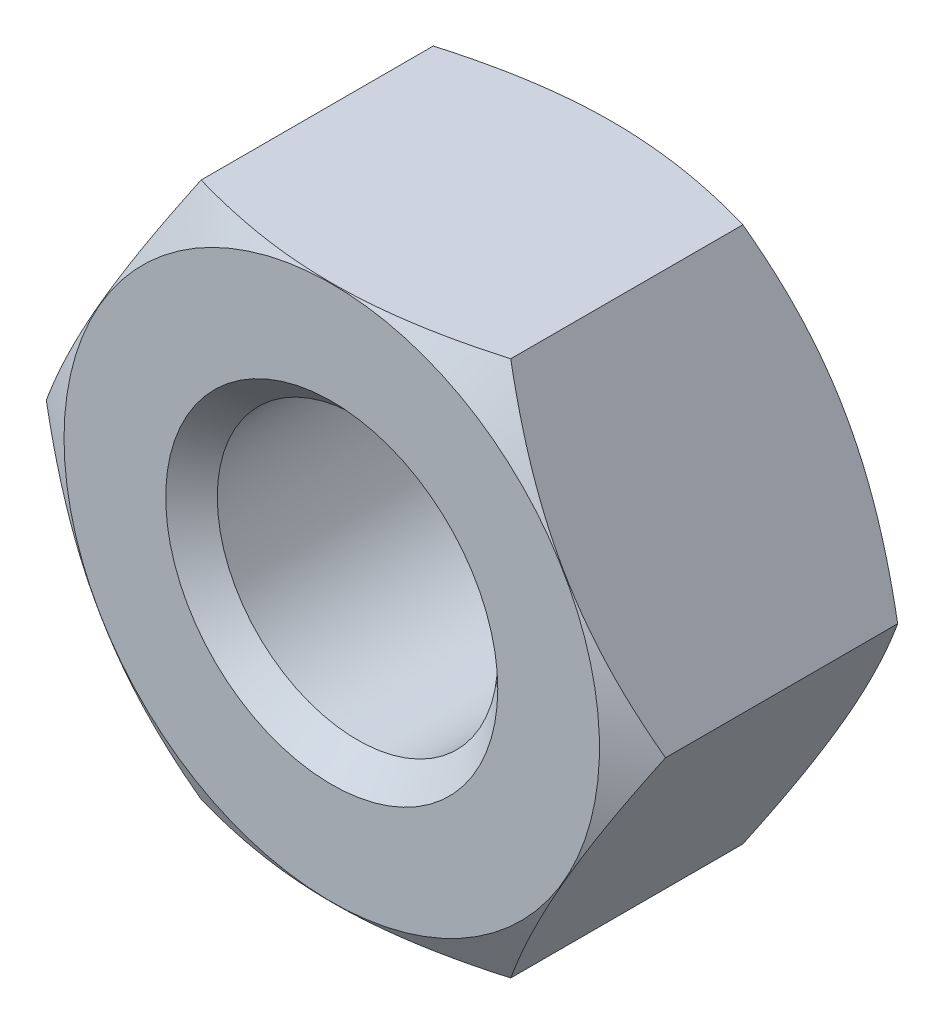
ISO-10303-21;
HEADER;
FILE_DESCRIPTION(('STEP AP214'),'2;1');
FILE_NAME('part.step','',(''),(''),'','','');
FILE_SCHEMA(('AUTOMOTIVE_DESIGN { 1 0 10303 214 1 1 1 1 }'));
ENDSEC;
DATA;
#1=APPLICATION_CONTEXT('core data for automotive mechanical design processes');
#2=APPLICATION_PROTOCOL_DEFINITION('international standard','automotive_design',2000,#1);
#3=PRODUCT_CONTEXT('',#1,'mechanical');
#4=PRODUCT('Part','Part','',(#3));
#5=PRODUCT_RELATED_PRODUCT_CATEGORY('part','',(#4));
#6=PRODUCT_DEFINITION_FORMATION('','',#4);
#7=PRODUCT_DEFINITION_CONTEXT('part definition',#1,'design');
#8=PRODUCT_DEFINITION('design','',#6,#7);
#9=PRODUCT_DEFINITION_SHAPE('','',#8);
#10=(LENGTH_UNIT() NAMED_UNIT(*) SI_UNIT(.MILLI.,.METRE.));
#11=(NAMED_UNIT(*) PLANE_ANGLE_UNIT() SI_UNIT($,.RADIAN.));
#12=(NAMED_UNIT(*) SI_UNIT($,.STERADIAN.) SOLID_ANGLE_UNIT());
#13=UNCERTAINTY_MEASURE_WITH_UNIT(LENGTH_MEASURE(1.E-05),#10,'distance_accuracy_value','');
#14=(GEOMETRIC_REPRESENTATION_CONTEXT(3) GLOBAL_UNCERTAINTY_ASSIGNED_CONTEXT((#13)) GLOBAL_UNIT_ASSIGNED_CONTEXT((#10,
#11,#12)) REPRESENTATION_CONTEXT('',''));
#15=CARTESIAN_POINT('',(0.,0.,0.));
#16=DIRECTION('',(0.,0.,1.));
#17=DIRECTION('',(1.,0.,0.));
#18=AXIS2_PLACEMENT_3D('',#15,#16,#17);
#19=CARTESIAN_POINT('',(-7.5055534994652,0.,6.8));
#20=DIRECTION('',(0.866025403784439,0.5,0.));
#21=DIRECTION('',(-0.5,0.866025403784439,0.));
#22=AXIS2_PLACEMENT_3D('',#19,#20,#21);
#23=PLANE('',#22);
#24=CARTESIAN_POINT('',(-3.75277679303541,-6.49999992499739,0.586330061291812));
#25=CARTESIAN_POINT('',(-3.83526615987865,-6.35712415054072,0.538713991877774));
#26=CARTESIAN_POINT('',(-3.91806308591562,-6.21371566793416,0.493259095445));
#27=CARTESIAN_POINT('',(-4.08432932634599,-5.92573409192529,0.407266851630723));
#28=CARTESIAN_POINT('',(-4.16779891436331,-5.78116052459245,0.366731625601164));
#29=CARTESIAN_POINT('',(-4.41954403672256,-5.34512518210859,0.253301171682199));
#30=CARTESIAN_POINT('',(-4.58881326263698,-5.05194228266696,0.188784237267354));
#31=CARTESIAN_POINT('',(-4.84212155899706,-4.61319944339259,0.113132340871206));
#32=CARTESIAN_POINT('',(-4.9254038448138,-4.46895029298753,0.0915816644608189));
#33=CARTESIAN_POINT('',(-5.09234467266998,-4.17980029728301,0.0554451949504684));
#34=CARTESIAN_POINT('',(-5.1760031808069,-4.03489951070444,0.0408587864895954));
#35=CARTESIAN_POINT('',(-5.3434654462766,-3.74484635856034,0.0190225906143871));
#36=CARTESIAN_POINT('',(-5.42726893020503,-3.59969446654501,0.0117644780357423));
#37=CARTESIAN_POINT('',(-5.59494862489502,-3.30926471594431,0.00473271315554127));
#38=CARTESIAN_POINT('',(-5.67882483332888,-3.16398686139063,0.00495882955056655));
#39=CARTESIAN_POINT('',(-5.90860388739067,-2.76599786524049,0.0158650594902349));
#40=CARTESIAN_POINT('',(-6.05443147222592,-2.51341707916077,0.0341645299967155));
#41=CARTESIAN_POINT('',(-6.34511809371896,-2.00993308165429,0.0921860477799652));
#42=CARTESIAN_POINT('',(-6.48997610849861,-1.75903164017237,0.131927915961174));
#43=CARTESIAN_POINT('',(-6.78124747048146,-1.2545348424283,0.231268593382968));
#44=CARTESIAN_POINT('',(-6.92762407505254,-1.00100312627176,0.291288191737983));
#45=CARTESIAN_POINT('',(-7.21819471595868,-0.497720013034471,0.427507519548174));
#46=CARTESIAN_POINT('',(-7.36239247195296,-0.247962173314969,0.503675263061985));
#47=CARTESIAN_POINT('',(-7.50555345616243,-7.50025959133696E-08,0.586330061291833));
#48=B_SPLINE_CURVE_WITH_KNOTS('',3,(#24,#25,#26,#27,#28,#29,#30,#31,#32,#33,#34,#35,#36,#37,#38,
#39,#40,#41,#42,#43,#44,#45,#46,#47),.UNSPECIFIED.,.F.,.F.,(4,2,2,2,2,2,2,2,2,2,2,4),(0.,
0.515097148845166,1.03041562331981,2.06319348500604,2.56693467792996,3.07063135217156,
3.57375516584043,4.07686343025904,4.95263079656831,5.82920909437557,6.72522569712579,
7.61948379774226),.UNSPECIFIED.);
#49=CARTESIAN_POINT('',(-3.75277676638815,-6.5,0.586330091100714));
#50=VERTEX_POINT('',#49);
#51=CARTESIAN_POINT('',(-7.50555347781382,-3.75013001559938E-08,0.586330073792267));
#52=VERTEX_POINT('',#51);
#53=EDGE_CURVE('E20',#50,#52,#48,.T.);
#54=ORIENTED_EDGE('',*,*,#53,.F.);
#55=DIRECTION('',(0.,0.,1.));
#56=VECTOR('',#55,1.);
#57=CARTESIAN_POINT('',(-3.75277674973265,-6.5,6.8));
#58=LINE('',#57,#56);
#59=CARTESIAN_POINT('',(-3.75277677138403,-6.49999996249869,6.21366992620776));
#60=VERTEX_POINT('',#59);
#61=EDGE_CURVE('E72',#50,#60,#58,.T.);
#62=ORIENTED_EDGE('',*,*,#61,.T.);
#63=CARTESIAN_POINT('',(-7.50555348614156,-2.30772143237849E-08,6.21366992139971));
#64=CARTESIAN_POINT('',(-7.42306411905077,-0.142875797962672,6.26128599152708));
#65=CARTESIAN_POINT('',(-7.34026719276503,-0.286284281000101,6.30674088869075));
#66=CARTESIAN_POINT('',(-7.17400095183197,-0.574265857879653,6.39273313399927));
#67=CARTESIAN_POINT('',(-7.09053136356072,-0.718839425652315,6.43326836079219));
#68=CARTESIAN_POINT('',(-6.83878624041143,-1.15487476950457,6.5466988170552));
#69=CARTESIAN_POINT('',(-6.66951701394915,-1.44805766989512,6.61121575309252));
#70=CARTESIAN_POINT('',(-6.41620871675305,-1.88680051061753,6.68686765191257));
#71=CARTESIAN_POINT('',(-6.3329264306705,-2.03104966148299,6.70841832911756));
#72=CARTESIAN_POINT('',(-6.16598560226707,-2.32019965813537,6.74455480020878));
#73=CARTESIAN_POINT('',(-6.0823270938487,-2.4651004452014,6.75914120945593));
#74=CARTESIAN_POINT('',(-5.91486482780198,-2.75515359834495,6.78097740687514));
#75=CARTESIAN_POINT('',(-5.83106134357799,-2.9003054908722,6.78823552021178));
#76=CARTESIAN_POINT('',(-5.66338164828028,-3.1907352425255,6.79526728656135));
#77=CARTESIAN_POINT('',(-5.57950543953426,-3.33601309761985,6.7950411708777));
#78=CARTESIAN_POINT('',(-5.34972638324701,-3.7340020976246,6.78413494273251));
#79=CARTESIAN_POINT('',(-5.20389879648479,-3.98658288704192,6.76583547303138));
#80=CARTESIAN_POINT('',(-4.91321217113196,-4.49006689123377,6.70781395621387));
#81=CARTESIAN_POINT('',(-4.76835415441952,-4.74096833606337,6.66807208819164));
#82=CARTESIAN_POINT('',(-4.47708278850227,-5.24546514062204,6.56873141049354));
#83=CARTESIAN_POINT('',(-4.33070618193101,-5.49899686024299,6.50871181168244));
#84=CARTESIAN_POINT('',(-4.04013553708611,-6.00227998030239,6.37249248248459));
#85=CARTESIAN_POINT('',(-3.89593777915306,-6.25203782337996,6.29632473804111));
#86=CARTESIAN_POINT('',(-3.75277679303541,-6.49999992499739,6.2136699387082));
#87=B_SPLINE_CURVE_WITH_KNOTS('',3,(#63,#64,#65,#66,#67,#68,#69,#70,#71,#72,#73,#74,#75,#76,#77,
#78,#79,#80,#81,#82,#83,#84,#85,#86),.UNSPECIFIED.,.F.,.F.,(4,2,2,2,2,2,2,2,2,2,2,4),(0.,
0.515097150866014,1.03041562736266,2.06319349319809,2.56693468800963,3.0706313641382,
3.57375517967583,4.07686344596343,4.95263082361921,5.82920913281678,6.72522574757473,
7.61948386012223),.UNSPECIFIED.);
#88=CARTESIAN_POINT('',(-7.50555349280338,1.15386047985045E-08,6.21366991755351));
#89=VERTEX_POINT('',#88);
#90=EDGE_CURVE('E91',#89,#60,#87,.T.);
#91=ORIENTED_EDGE('',*,*,#90,.F.);
#92=DIRECTION('',(0.,0.,1.));
#93=VECTOR('',#92,1.);
#94=CARTESIAN_POINT('',(-7.5055534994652,0.,6.8));
#95=LINE('',#94,#93);
#96=EDGE_CURVE('E90',#89,#52,#95,.F.);
#97=ORIENTED_EDGE('',*,*,#96,.T.);
#98=EDGE_LOOP('',(#54,#62,#91,#97));
#99=FACE_BOUND('',#98,.T.);
#100=ADVANCED_FACE('F16',(#99),#23,.F.);
#101=CARTESIAN_POINT('',(-3.75277674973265,-6.5,6.8));
#102=DIRECTION('',(0.,1.,0.));
#103=DIRECTION('',(-1.,0.,0.));
#104=AXIS2_PLACEMENT_3D('',#101,#102,#103);
#105=PLANE('',#104);
#106=CARTESIAN_POINT('',(3.75277678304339,-6.50000000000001,0.586330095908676));
#107=CARTESIAN_POINT('',(3.58779804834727,-6.50000000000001,0.538714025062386));
#108=CARTESIAN_POINT('',(3.42220419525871,-6.50000000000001,0.493259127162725));
#109=CARTESIAN_POINT('',(3.08967171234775,-6.50000000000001,0.407266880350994));
#110=CARTESIAN_POINT('',(2.92273253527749,-6.50000000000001,0.366731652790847));
#111=CARTESIAN_POINT('',(2.41924228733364,-6.50000000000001,0.253301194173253));
#112=CARTESIAN_POINT('',(2.08070383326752,-6.50000000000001,0.188784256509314));
#113=CARTESIAN_POINT('',(1.57408723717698,-6.50000000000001,0.113132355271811));
#114=CARTESIAN_POINT('',(1.40752266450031,-6.50000000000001,0.0915816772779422));
#115=CARTESIAN_POINT('',(1.07364100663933,-6.50000000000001,0.0554452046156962));
#116=CARTESIAN_POINT('',(0.906323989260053,-6.50000000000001,0.0408587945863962));
#117=CARTESIAN_POINT('',(0.571399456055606,-6.50000000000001,0.0190225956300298));
#118=CARTESIAN_POINT('',(0.403792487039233,-6.50000000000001,0.011764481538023));
#119=CARTESIAN_POINT('',(0.0684330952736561,-6.50000000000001,0.00473271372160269));
#120=CARTESIAN_POINT('',(-0.0993193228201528,-6.50000000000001,0.00495882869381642));
#121=CARTESIAN_POINT('',(-0.55887744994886,-6.50000000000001,0.0158650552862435));
#122=CARTESIAN_POINT('',(-0.850532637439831,-6.50000000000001,0.0341645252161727));
#123=CARTESIAN_POINT('',(-1.43190591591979,-6.5,0.0921860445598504));
#124=CARTESIAN_POINT('',(-1.72162196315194,-6.5,0.131927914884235));
#125=CARTESIAN_POINT('',(-2.30416472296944,-6.5,0.231268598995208));
#126=CARTESIAN_POINT('',(-2.59691795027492,-6.5,0.29128820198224));
#127=CARTESIAN_POINT('',(-3.17805926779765,-6.5,0.427507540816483));
#128=CARTESIAN_POINT('',(-3.46645479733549,-6.5,0.503675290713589));
#129=CARTESIAN_POINT('',(-3.75277678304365,-6.5,0.586330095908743));
#130=B_SPLINE_CURVE_WITH_KNOTS('',3,(#106,#107,#108,#109,#110,#111,#112,#113,#114,#115,#116,
#117,#118,#119,#120,#121,#122,#123,#124,#125,#126,#127,#128,#129),.UNSPECIFIED.,.F.,.F.,(4,2,2,
2,2,2,2,2,2,2,2,4),(0.,0.51509715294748,1.03041563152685,2.06319350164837,2.56693469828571,
3.07063137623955,3.57375519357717,4.07686346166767,4.95263088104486,5.82920923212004,
6.7252258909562,7.61948404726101),.UNSPECIFIED.);
#131=CARTESIAN_POINT('',(3.75277677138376,-6.49999996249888,0.586330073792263));
#132=VERTEX_POINT('',#131);
#133=EDGE_CURVE('E86',#132,#50,#130,.T.);
#134=ORIENTED_EDGE('',*,*,#133,.F.);
#135=DIRECTION('',(0.,0.,1.));
#136=VECTOR('',#135,1.);
#137=CARTESIAN_POINT('',(3.75277674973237,-6.50000000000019,6.8));
#138=LINE('',#137,#136);
#139=CARTESIAN_POINT('',(3.75277670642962,-6.5000000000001,6.21366992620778));
#140=VERTEX_POINT('',#139);
#141=EDGE_CURVE('E228',#132,#140,#138,.T.);
#142=ORIENTED_EDGE('',*,*,#141,.T.);
#143=CARTESIAN_POINT('',(-3.75277678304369,-6.5,6.21366990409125));
#144=CARTESIAN_POINT('',(-3.58779804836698,-6.5,6.26128597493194));
#145=CARTESIAN_POINT('',(-3.42220419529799,-6.5,6.30674087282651));
#146=CARTESIAN_POINT('',(-3.08967171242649,-6.5,6.39273311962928));
#147=CARTESIAN_POINT('',(-2.92273253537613,-6.5,6.43326834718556));
#148=CARTESIAN_POINT('',(-2.41924228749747,-6.5,6.54669880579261));
#149=CARTESIAN_POINT('',(-2.08070383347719,-6.5,6.61121574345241));
#150=CARTESIAN_POINT('',(-1.57408723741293,-6.5,6.68686764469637));
#151=CARTESIAN_POINT('',(-1.40752266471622,-6.50000000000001,6.70841832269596));
#152=CARTESIAN_POINT('',(-1.07364100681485,-6.50000000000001,6.74455479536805));
#153=CARTESIAN_POINT('',(-0.906323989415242,-6.50000000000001,6.75914120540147));
#154=CARTESIAN_POINT('',(-0.571399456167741,-6.50000000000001,6.78097740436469));
#155=CARTESIAN_POINT('',(-0.403792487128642,-6.50000000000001,6.78823551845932));
#156=CARTESIAN_POINT('',(-0.0684330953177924,-6.50000000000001,6.79526728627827));
#157=CARTESIAN_POINT('',(0.0993193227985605,-6.50000000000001,6.795041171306));
#158=CARTESIAN_POINT('',(0.558877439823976,-6.50000000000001,6.78413494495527));
#159=CARTESIAN_POINT('',(0.850532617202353,-6.50000000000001,6.7658354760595));
#160=CARTESIAN_POINT('',(1.43190587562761,-6.50000000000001,6.70781396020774));
#161=CARTESIAN_POINT('',(1.72162191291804,-6.50000000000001,6.66807209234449));
#162=CARTESIAN_POINT('',(2.30416465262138,-6.50000000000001,6.56873141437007));
#163=CARTESIAN_POINT('',(2.59691786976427,-6.50000000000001,6.50871181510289));
#164=CARTESIAN_POINT('',(3.17805916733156,-6.50000000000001,6.37249248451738));
#165=CARTESIAN_POINT('',(3.46645468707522,-6.50000000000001,6.29632473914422));
#166=CARTESIAN_POINT('',(3.75277666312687,-6.50000000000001,6.21366993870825));
#167=B_SPLINE_CURVE_WITH_KNOTS('',3,(#143,#144,#145,#146,#147,#148,#149,#150,#151,#152,#153,
#154,#155,#156,#157,#158,#159,#160,#161,#162,#163,#164,#165,#166),.UNSPECIFIED.,.F.,.F.,(4,2,2,
2,2,2,2,2,2,2,2,4),(0.,0.51509715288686,1.0304156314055,2.06319350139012,2.56693469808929,
3.07063137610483,3.57375519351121,4.07686346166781,4.95263085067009,5.82920917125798,
6.72522579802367,7.6194839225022),.UNSPECIFIED.);
#168=EDGE_CURVE('E162',#60,#140,#167,.T.);
#169=ORIENTED_EDGE('',*,*,#168,.F.);
#170=ORIENTED_EDGE('',*,*,#61,.F.);
#171=EDGE_LOOP('',(#134,#142,#169,#170));
#172=FACE_BOUND('',#171,.T.);
#173=ADVANCED_FACE('F169',(#172),#105,.F.);
#174=CARTESIAN_POINT('',(3.75277674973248,-6.5,6.8));
#175=DIRECTION('',(-0.866025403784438,0.5,0.));
#176=DIRECTION('',(-0.5,-0.866025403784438,0.));
#177=AXIS2_PLACEMENT_3D('',#174,#175,#176);
#178=PLANE('',#177);
#179=CARTESIAN_POINT('',(7.50555348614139,-2.30772496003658E-08,0.586330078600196));
#180=CARTESIAN_POINT('',(7.4230641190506,-0.142875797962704,0.538714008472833));
#181=CARTESIAN_POINT('',(7.34026719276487,-0.28628428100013,0.493259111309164));
#182=CARTESIAN_POINT('',(7.17400095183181,-0.574265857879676,0.407266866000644));
#183=CARTESIAN_POINT('',(7.09053136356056,-0.718839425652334,0.366731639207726));
#184=CARTESIAN_POINT('',(6.83878624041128,-1.15487476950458,0.253301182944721));
#185=CARTESIAN_POINT('',(6.669517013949,-1.44805766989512,0.188784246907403));
#186=CARTESIAN_POINT('',(6.4162087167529,-1.88680051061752,0.11313234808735));
#187=CARTESIAN_POINT('',(6.33292643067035,-2.03104966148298,0.0915816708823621));
#188=CARTESIAN_POINT('',(6.16598560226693,-2.32019965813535,0.0554451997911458));
#189=CARTESIAN_POINT('',(6.08232709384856,-2.46510044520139,0.0408587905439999));
#190=CARTESIAN_POINT('',(5.91486482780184,-2.75515359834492,0.0190225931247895));
#191=CARTESIAN_POINT('',(5.83106134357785,-2.90030549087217,0.0117644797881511));
#192=CARTESIAN_POINT('',(5.66338164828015,-3.19073524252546,0.00473271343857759));
#193=CARTESIAN_POINT('',(5.57950543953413,-3.33601309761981,0.004958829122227));
#194=CARTESIAN_POINT('',(5.34972638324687,-3.73400209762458,0.0158650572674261));
#195=CARTESIAN_POINT('',(5.20389879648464,-3.98658288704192,0.0341645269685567));
#196=CARTESIAN_POINT('',(4.91321217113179,-4.4900668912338,0.0921860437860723));
#197=CARTESIAN_POINT('',(4.76835415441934,-4.74096833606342,0.131927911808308));
#198=CARTESIAN_POINT('',(4.47708278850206,-5.24546514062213,0.231268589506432));
#199=CARTESIAN_POINT('',(4.33070618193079,-5.49899686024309,0.291288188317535));
#200=CARTESIAN_POINT('',(4.04013553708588,-6.00227998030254,0.42750751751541));
#201=CARTESIAN_POINT('',(3.89593777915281,-6.25203782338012,0.503675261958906));
#202=CARTESIAN_POINT('',(3.75277679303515,-6.49999992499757,0.586330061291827));
#203=B_SPLINE_CURVE_WITH_KNOTS('',3,(#179,#180,#181,#182,#183,#184,#185,#186,#187,#188,#189,
#190,#191,#192,#193,#194,#195,#196,#197,#198,#199,#200,#201,#202),.UNSPECIFIED.,.F.,.F.,(4,2,2,
2,2,2,2,2,2,2,2,4),(0.,0.515097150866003,1.03041562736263,2.06319349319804,2.56693468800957,
3.07063136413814,3.57375517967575,4.07686344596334,4.95263082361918,5.82920913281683,
6.72522574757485,7.61948386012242),.UNSPECIFIED.);
#204=CARTESIAN_POINT('',(7.50555349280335,1.15383756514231E-08,0.58633008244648));
#205=VERTEX_POINT('',#204);
#206=EDGE_CURVE('E127',#205,#132,#203,.T.);
#207=ORIENTED_EDGE('',*,*,#206,.F.);
#208=DIRECTION('',(0.,0.,1.));
#209=VECTOR('',#208,1.);
#210=CARTESIAN_POINT('',(7.5055534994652,-2.89814648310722E-13,6.8));
#211=LINE('',#210,#209);
#212=CARTESIAN_POINT('',(7.50555347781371,-3.75015010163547E-08,6.2136699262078));
#213=VERTEX_POINT('',#212);
#214=EDGE_CURVE('E231',#205,#213,#211,.T.);
#215=ORIENTED_EDGE('',*,*,#214,.T.);
#216=CARTESIAN_POINT('',(3.7527767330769,-6.50000002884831,6.21366990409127));
#217=CARTESIAN_POINT('',(3.83526610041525,-6.35712425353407,6.26128597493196));
#218=CARTESIAN_POINT('',(3.91806302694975,-6.21371577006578,6.30674087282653));
#219=CARTESIAN_POINT('',(4.0843292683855,-5.92573419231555,6.3927331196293));
#220=CARTESIAN_POINT('',(4.16779885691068,-5.78116062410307,6.43326834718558));
#221=CARTESIAN_POINT('',(4.41954398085,-5.34512527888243,6.54669880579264));
#222=CARTESIAN_POINT('',(4.58881320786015,-5.05194237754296,6.61121574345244));
#223=CARTESIAN_POINT('',(4.84212150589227,-4.61319953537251,6.68686764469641));
#224=CARTESIAN_POINT('',(4.92540379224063,-4.46895038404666,6.70841832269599));
#225=CARTESIAN_POINT('',(5.09234462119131,-4.17980038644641,6.74455479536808));
#226=CARTESIAN_POINT('',(5.17600312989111,-4.03489959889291,6.75914120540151));
#227=CARTESIAN_POINT('',(5.34346539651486,-3.74484644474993,6.78097740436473));
#228=CARTESIAN_POINT('',(5.42726888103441,-3.59969455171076,6.78823551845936));
#229=CARTESIAN_POINT('',(5.59494857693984,-3.30926479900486,6.79526728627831));
#230=CARTESIAN_POINT('',(5.67882478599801,-3.16398694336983,6.79504117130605));
#231=CARTESIAN_POINT('',(5.90860384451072,-2.76599793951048,6.78413494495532));
#232=CARTESIAN_POINT('',(6.05443143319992,-2.51341714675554,6.76583547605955));
#233=CARTESIAN_POINT('',(6.34511806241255,-2.00993313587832,6.70781396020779));
#234=CARTESIAN_POINT('',(6.48997608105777,-1.75903168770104,6.66807209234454));
#235=CARTESIAN_POINT('',(6.78124745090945,-1.25453487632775,6.56873141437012));
#236=CARTESIAN_POINT('',(6.9276240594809,-1.00100315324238,6.50871181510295));
#237=CARTESIAN_POINT('',(7.21819470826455,-0.497720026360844,6.37249248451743));
#238=CARTESIAN_POINT('',(7.36239246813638,-0.24796217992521,6.29632473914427));
#239=CARTESIAN_POINT('',(7.50555345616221,-7.50027126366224E-08,6.2136699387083));
#240=B_SPLINE_CURVE_WITH_KNOTS('',3,(#216,#217,#218,#219,#220,#221,#222,#223,#224,#225,#226,
#227,#228,#229,#230,#231,#232,#233,#234,#235,#236,#237,#238,#239),.UNSPECIFIED.,.F.,.F.,(4,2,2,
2,2,2,2,2,2,2,2,4),(0.,0.515097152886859,1.0304156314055,2.06319350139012,2.56693469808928,
3.07063137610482,3.5737551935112,4.0768634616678,4.9526308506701,5.82920917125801,
6.72522579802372,7.61948392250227),.UNSPECIFIED.);
#241=EDGE_CURVE('E153',#140,#213,#240,.T.);
#242=ORIENTED_EDGE('',*,*,#241,.F.);
#243=ORIENTED_EDGE('',*,*,#141,.F.);
#244=EDGE_LOOP('',(#207,#215,#242,#243));
#245=FACE_BOUND('',#244,.T.);
#246=ADVANCED_FACE('F141',(#245),#178,.F.);
#247=CARTESIAN_POINT('',(7.50555349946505,0.,6.8));
#248=DIRECTION('',(-0.866025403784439,-0.5,0.));
#249=DIRECTION('',(0.5,-0.866025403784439,0.));
#250=AXIS2_PLACEMENT_3D('',#247,#248,#249);
#251=PLANE('',#250);
#252=CARTESIAN_POINT('',(3.75277673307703,6.50000002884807,0.586330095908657));
#253=CARTESIAN_POINT('',(3.83526610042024,6.35712425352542,0.538714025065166));
#254=CARTESIAN_POINT('',(3.91806302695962,6.21371577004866,0.493259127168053));
#255=CARTESIAN_POINT('',(4.08432926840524,5.92573419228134,0.407266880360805));
#256=CARTESIAN_POINT('',(4.16779885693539,5.78116062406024,0.366731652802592));
#257=CARTESIAN_POINT('',(4.41954398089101,5.34512527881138,0.253301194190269));
#258=CARTESIAN_POINT('',(4.58881320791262,5.05194237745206,0.188784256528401));
#259=CARTESIAN_POINT('',(4.84212150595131,4.61319953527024,0.113132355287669));
#260=CARTESIAN_POINT('',(4.92540379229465,4.46895038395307,0.0915816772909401));
#261=CARTESIAN_POINT('',(5.09234462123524,4.17980038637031,0.0554452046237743));
#262=CARTESIAN_POINT('',(5.17600312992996,4.03489959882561,0.0408587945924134));
#263=CARTESIAN_POINT('',(5.34346539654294,3.74484644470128,0.0190225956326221));
#264=CARTESIAN_POINT('',(5.42726888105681,3.59969455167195,0.0117644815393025));
#265=CARTESIAN_POINT('',(5.59494857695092,3.30926479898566,0.00473271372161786));
#266=CARTESIAN_POINT('',(5.67882478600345,3.16398694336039,0.00495882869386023));
#267=CARTESIAN_POINT('',(5.90860384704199,2.76599793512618,0.0158650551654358));
#268=CARTESIAN_POINT('',(6.05443143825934,2.51341713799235,0.0341645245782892));
#269=CARTESIAN_POINT('',(6.34511807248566,2.00993311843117,0.092186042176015));
#270=CARTESIAN_POINT('',(6.48997609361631,1.75903166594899,0.131927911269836));
#271=CARTESIAN_POINT('',(6.78124746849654,1.254534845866,0.231268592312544));
#272=CARTESIAN_POINT('',(6.92762407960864,1.00100311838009,0.291288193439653));
#273=CARTESIAN_POINT('',(7.21819473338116,0.497719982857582,0.427507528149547));
#274=CARTESIAN_POINT('',(7.36239249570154,0.247962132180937,0.503675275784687));
#275=CARTESIAN_POINT('',(7.5055534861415,2.3077041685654E-08,0.586330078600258));
#276=B_SPLINE_CURVE_WITH_KNOTS('',3,(#252,#253,#254,#255,#256,#257,#258,#259,#260,#261,#262,
#263,#264,#265,#266,#267,#268,#269,#270,#271,#272,#273,#274,#275),.UNSPECIFIED.,.F.,.F.,(4,2,2,
2,2,2,2,2,2,2,2,4),(0.,0.515097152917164,1.03041563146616,2.06319350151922,2.56693469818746,
3.07063137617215,3.57375519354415,4.07686346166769,4.95263086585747,5.82920920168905,
6.72522584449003,7.61948398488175),.UNSPECIFIED.);
#277=CARTESIAN_POINT('',(3.75277670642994,6.5,0.586330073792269));
#278=VERTEX_POINT('',#277);
#279=EDGE_CURVE('E98',#278,#205,#276,.T.);
#280=ORIENTED_EDGE('',*,*,#279,.F.);
#281=DIRECTION('',(0.,0.,1.));
#282=VECTOR('',#281,1.);
#283=CARTESIAN_POINT('',(3.75277674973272,6.5,6.8));
#284=LINE('',#283,#282);
#285=CARTESIAN_POINT('',(3.752776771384,6.49999996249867,6.21366992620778));
#286=VERTEX_POINT('',#285);
#287=EDGE_CURVE('E94',#278,#286,#284,.T.);
#288=ORIENTED_EDGE('',*,*,#287,.T.);
#289=CARTESIAN_POINT('',(7.50555351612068,-2.88484203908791E-08,6.21366990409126));
#290=CARTESIAN_POINT('',(7.42306414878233,0.142875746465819,6.26128597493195));
#291=CARTESIAN_POINT('',(7.34026722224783,0.286284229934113,6.30674087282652));
#292=CARTESIAN_POINT('',(7.17400098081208,0.574265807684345,6.39273311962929));
#293=CARTESIAN_POINT('',(7.0905313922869,0.718839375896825,6.43326834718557));
#294=CARTESIAN_POINT('',(6.83878626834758,1.15487472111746,6.54669880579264));
#295=CARTESIAN_POINT('',(6.66951704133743,1.44805762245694,6.61121574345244));
#296=CARTESIAN_POINT('',(6.41620874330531,1.88680046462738,6.68686764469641));
#297=CARTESIAN_POINT('',(6.33292645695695,2.03104961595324,6.708418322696));
#298=CARTESIAN_POINT('',(6.16598562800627,2.32019961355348,6.74455479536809));
#299=CARTESIAN_POINT('',(6.08232711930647,2.46510040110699,6.75914120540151));
#300=CARTESIAN_POINT('',(5.91486485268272,2.75515355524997,6.78097740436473));
#301=CARTESIAN_POINT('',(5.83106136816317,2.90030544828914,6.78823551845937));
#302=CARTESIAN_POINT('',(5.66338167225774,3.19073520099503,6.79526728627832));
#303=CARTESIAN_POINT('',(5.57950546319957,3.33601305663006,6.79504117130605));
#304=CARTESIAN_POINT('',(5.34972640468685,3.73400206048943,6.78413494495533));
#305=CARTESIAN_POINT('',(5.20389881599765,3.98658285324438,6.76583547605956));
#306=CARTESIAN_POINT('',(4.913212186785,4.49006686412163,6.70781396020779));
#307=CARTESIAN_POINT('',(4.76835416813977,4.74096831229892,6.66807209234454));
#308=CARTESIAN_POINT('',(4.47708279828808,5.24546512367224,6.56873141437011));
#309=CARTESIAN_POINT('',(4.33070618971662,5.49899684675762,6.50871181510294));
#310=CARTESIAN_POINT('',(4.04013554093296,6.00227997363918,6.37249248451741));
#311=CARTESIAN_POINT('',(3.89593778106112,6.25203782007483,6.29632473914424));
#312=CARTESIAN_POINT('',(3.75277679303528,6.49999992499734,6.21366993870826));
#313=B_SPLINE_CURVE_WITH_KNOTS('',3,(#289,#290,#291,#292,#293,#294,#295,#296,#297,#298,#299,
#300,#301,#302,#303,#304,#305,#306,#307,#308,#309,#310,#311,#312),.UNSPECIFIED.,.F.,.F.,(4,2,2,
2,2,2,2,2,2,2,2,4),(0.,0.515097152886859,1.0304156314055,2.06319350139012,2.56693469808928,
3.07063137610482,3.57375519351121,4.0768634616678,4.95263085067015,5.8292091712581,
6.72522579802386,7.61948392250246),.UNSPECIFIED.);
#314=EDGE_CURVE('E147',#213,#286,#313,.T.);
#315=ORIENTED_EDGE('',*,*,#314,.F.);
#316=ORIENTED_EDGE('',*,*,#214,.F.);
#317=EDGE_LOOP('',(#280,#288,#315,#316));
#318=FACE_BOUND('',#317,.T.);
#319=ADVANCED_FACE('F137',(#318),#251,.F.);
#320=CARTESIAN_POINT('',(3.7527767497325,6.5,6.8));
#321=DIRECTION('',(0.,-1.,0.));
#322=DIRECTION('',(1.,0.,0.));
#323=AXIS2_PLACEMENT_3D('',#320,#321,#322);
#324=PLANE('',#323);
#325=CARTESIAN_POINT('',(-3.7527767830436,6.50000000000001,0.586330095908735));
#326=CARTESIAN_POINT('',(-3.5877980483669,6.50000000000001,0.538714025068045));
#327=CARTESIAN_POINT('',(-3.4222041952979,6.50000000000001,0.493259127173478));
#328=CARTESIAN_POINT('',(-3.0896717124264,6.50000000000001,0.407266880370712));
#329=CARTESIAN_POINT('',(-2.92273253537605,6.50000000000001,0.366731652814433));
#330=CARTESIAN_POINT('',(-2.41924228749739,6.50000000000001,0.253301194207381));
#331=CARTESIAN_POINT('',(-2.08070383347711,6.50000000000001,0.188784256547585));
#332=CARTESIAN_POINT('',(-1.57408723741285,6.50000000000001,0.113132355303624));
#333=CARTESIAN_POINT('',(-1.40752266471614,6.50000000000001,0.0915816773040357));
#334=CARTESIAN_POINT('',(-1.07364100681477,6.50000000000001,0.0554452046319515));
#335=CARTESIAN_POINT('',(-0.906323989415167,6.50000000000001,0.0408587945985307));
#336=CARTESIAN_POINT('',(-0.571399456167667,6.50000000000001,0.019022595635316));
#337=CARTESIAN_POINT('',(-0.403792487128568,6.50000000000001,0.0117644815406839));
#338=CARTESIAN_POINT('',(-0.0684330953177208,6.50000000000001,0.00473271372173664));
#339=CARTESIAN_POINT('',(0.0993193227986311,6.50000000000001,0.00495882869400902));
#340=CARTESIAN_POINT('',(0.558877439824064,6.50000000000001,0.015865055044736));
#341=CARTESIAN_POINT('',(0.850532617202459,6.50000000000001,0.0341645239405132));
#342=CARTESIAN_POINT('',(1.43190587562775,6.50000000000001,0.0921860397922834));
#343=CARTESIAN_POINT('',(1.7216219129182,6.5,0.131927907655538));
#344=CARTESIAN_POINT('',(2.30416465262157,6.5,0.231268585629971));
#345=CARTESIAN_POINT('',(2.59691786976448,6.5,0.291288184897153));
#346=CARTESIAN_POINT('',(3.1780591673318,6.5,0.427507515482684));
#347=CARTESIAN_POINT('',(3.46645468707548,6.5,0.503675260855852));
#348=CARTESIAN_POINT('',(3.75277666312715,6.5,0.586330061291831));
#349=B_SPLINE_CURVE_WITH_KNOTS('',3,(#325,#326,#327,#328,#329,#330,#331,#332,#333,#334,#335,
#336,#337,#338,#339,#340,#341,#342,#343,#344,#345,#346,#347,#348),.UNSPECIFIED.,.F.,.F.,(4,2,2,
2,2,2,2,2,2,2,2,4),(0.,0.515097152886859,1.03041563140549,2.06319350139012,2.56693469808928,
3.07063137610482,3.5737551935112,4.07686346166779,4.95263085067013,5.82920917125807,
6.72522579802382,7.6194839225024),.UNSPECIFIED.);
#350=CARTESIAN_POINT('',(-3.752776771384,6.49999996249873,0.586330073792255));
#351=VERTEX_POINT('',#350);
#352=EDGE_CURVE('E97',#351,#278,#349,.T.);
#353=ORIENTED_EDGE('',*,*,#352,.F.);
#354=DIRECTION('',(0.,0.,1.));
#355=VECTOR('',#354,1.);
#356=CARTESIAN_POINT('',(-3.75277674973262,6.50000000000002,6.8));
#357=LINE('',#356,#355);
#358=CARTESIAN_POINT('',(-3.75277670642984,6.50000000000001,6.21366992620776));
#359=VERTEX_POINT('',#358);
#360=EDGE_CURVE('E88',#351,#359,#357,.T.);
#361=ORIENTED_EDGE('',*,*,#360,.T.);
#362=CARTESIAN_POINT('',(3.75277678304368,6.5,6.21366990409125));
#363=CARTESIAN_POINT('',(3.58779804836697,6.5,6.26128597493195));
#364=CARTESIAN_POINT('',(3.42220419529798,6.5,6.30674087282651));
#365=CARTESIAN_POINT('',(3.08967171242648,6.5,6.39273311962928));
#366=CARTESIAN_POINT('',(2.92273253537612,6.5,6.43326834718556));
#367=CARTESIAN_POINT('',(2.41924228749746,6.5,6.54669880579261));
#368=CARTESIAN_POINT('',(2.08070383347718,6.5,6.61121574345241));
#369=CARTESIAN_POINT('',(1.57408723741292,6.5,6.68686764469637));
#370=CARTESIAN_POINT('',(1.40752266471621,6.5,6.70841832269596));
#371=CARTESIAN_POINT('',(1.07364100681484,6.5,6.74455479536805));
#372=CARTESIAN_POINT('',(0.906323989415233,6.50000000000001,6.75914120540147));
#373=CARTESIAN_POINT('',(0.571399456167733,6.50000000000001,6.78097740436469));
#374=CARTESIAN_POINT('',(0.403792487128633,6.50000000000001,6.78823551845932));
#375=CARTESIAN_POINT('',(0.0684330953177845,6.50000000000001,6.79526728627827));
#376=CARTESIAN_POINT('',(-0.0993193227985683,6.50000000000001,6.795041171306));
#377=CARTESIAN_POINT('',(-0.558877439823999,6.50000000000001,6.78413494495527));
#378=CARTESIAN_POINT('',(-0.850532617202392,6.50000000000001,6.7658354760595));
#379=CARTESIAN_POINT('',(-1.43190587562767,6.50000000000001,6.70781396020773));
#380=CARTESIAN_POINT('',(-1.72162191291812,6.50000000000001,6.66807209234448));
#381=CARTESIAN_POINT('',(-2.30416465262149,6.50000000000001,6.56873141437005));
#382=CARTESIAN_POINT('',(-2.59691786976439,6.50000000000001,6.50871181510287));
#383=CARTESIAN_POINT('',(-3.17805916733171,6.50000000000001,6.37249248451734));
#384=CARTESIAN_POINT('',(-3.46645468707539,6.50000000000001,6.29632473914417));
#385=CARTESIAN_POINT('',(-3.75277666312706,6.50000000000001,6.2136699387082));
#386=B_SPLINE_CURVE_WITH_KNOTS('',3,(#362,#363,#364,#365,#366,#367,#368,#369,#370,#371,#372,
#373,#374,#375,#376,#377,#378,#379,#380,#381,#382,#383,#384,#385),.UNSPECIFIED.,.F.,.F.,(4,2,2,
2,2,2,2,2,2,2,2,4),(0.,0.515097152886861,1.0304156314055,2.06319350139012,2.56693469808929,
3.07063137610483,3.57375519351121,4.07686346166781,4.95263085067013,5.82920917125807,
6.7252257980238,7.61948392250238),.UNSPECIFIED.);
#387=EDGE_CURVE('E39',#286,#359,#386,.T.);
#388=ORIENTED_EDGE('',*,*,#387,.F.);
#389=ORIENTED_EDGE('',*,*,#287,.F.);
#390=EDGE_LOOP('',(#353,#361,#388,#389));
#391=FACE_BOUND('',#390,.T.);
#392=ADVANCED_FACE('F140',(#391),#324,.F.);
#393=CARTESIAN_POINT('',(-3.75277674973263,6.5,6.8));
#394=DIRECTION('',(0.866025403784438,-0.5,0.));
#395=DIRECTION('',(0.5,0.866025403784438,0.));
#396=AXIS2_PLACEMENT_3D('',#393,#394,#395);
#397=PLANE('',#396);
#398=CARTESIAN_POINT('',(-7.5055535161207,-2.88481718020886E-08,0.586330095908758));
#399=CARTESIAN_POINT('',(-7.42306414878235,0.142875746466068,0.538714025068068));
#400=CARTESIAN_POINT('',(-7.34026722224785,0.286284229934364,0.493259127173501));
#401=CARTESIAN_POINT('',(-7.1740009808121,0.574265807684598,0.407266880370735));
#402=CARTESIAN_POINT('',(-7.09053139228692,0.718839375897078,0.366731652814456));
#403=CARTESIAN_POINT('',(-6.83878626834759,1.15487472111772,0.253301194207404));
#404=CARTESIAN_POINT('',(-6.66951704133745,1.4480576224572,0.18878425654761));
#405=CARTESIAN_POINT('',(-6.41620874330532,1.88680046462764,0.113132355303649));
#406=CARTESIAN_POINT('',(-6.33292645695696,2.0310496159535,0.0915816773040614));
#407=CARTESIAN_POINT('',(-6.16598562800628,2.32019961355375,0.0554452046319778));
#408=CARTESIAN_POINT('',(-6.08232711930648,2.46510040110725,0.0408587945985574));
#409=CARTESIAN_POINT('',(-5.91486485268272,2.75515355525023,0.0190225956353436));
#410=CARTESIAN_POINT('',(-5.83106136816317,2.9003054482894,0.0117644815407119));
#411=CARTESIAN_POINT('',(-5.66338167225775,3.1907352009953,0.00473271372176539));
#412=CARTESIAN_POINT('',(-5.57950546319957,3.33601305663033,0.00495882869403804));
#413=CARTESIAN_POINT('',(-5.34972640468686,3.73400206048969,0.0158650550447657));
#414=CARTESIAN_POINT('',(-5.20389881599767,3.98658285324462,0.0341645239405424));
#415=CARTESIAN_POINT('',(-4.91321218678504,4.49006686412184,0.0921860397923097));
#416=CARTESIAN_POINT('',(-4.76835416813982,4.74096831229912,0.131927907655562));
#417=CARTESIAN_POINT('',(-4.47708279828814,5.2454651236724,0.231268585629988));
#418=CARTESIAN_POINT('',(-4.3307061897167,5.49899684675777,0.291288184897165));
#419=CARTESIAN_POINT('',(-4.04013554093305,6.0022799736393,0.427507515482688));
#420=CARTESIAN_POINT('',(-3.89593778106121,6.25203782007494,0.503675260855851));
#421=CARTESIAN_POINT('',(-3.75277679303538,6.49999992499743,0.586330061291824));
#422=B_SPLINE_CURVE_WITH_KNOTS('',3,(#398,#399,#400,#401,#402,#403,#404,#405,#406,#407,#408,
#409,#410,#411,#412,#413,#414,#415,#416,#417,#418,#419,#420,#421),.UNSPECIFIED.,.F.,.F.,(4,2,2,
2,2,2,2,2,2,2,2,4),(0.,0.515097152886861,1.0304156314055,2.06319350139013,2.56693469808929,
3.07063137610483,3.57375519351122,4.07686346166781,4.95263085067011,5.82920917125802,
6.72522579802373,7.61948392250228),.UNSPECIFIED.);
#423=EDGE_CURVE('E84',#52,#351,#422,.T.);
#424=ORIENTED_EDGE('',*,*,#423,.F.);
#425=ORIENTED_EDGE('',*,*,#96,.F.);
#426=CARTESIAN_POINT('',(-3.75277673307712,6.50000002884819,6.21366990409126));
#427=CARTESIAN_POINT('',(-3.83526610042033,6.35712425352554,6.26128597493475));
#428=CARTESIAN_POINT('',(-3.91806302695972,6.21371577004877,6.30674087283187));
#429=CARTESIAN_POINT('',(-4.08432926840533,5.92573419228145,6.39273311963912));
#430=CARTESIAN_POINT('',(-4.16779885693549,5.78116062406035,6.43326834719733));
#431=CARTESIAN_POINT('',(-4.41954398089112,5.34512527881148,6.54669880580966));
#432=CARTESIAN_POINT('',(-4.58881320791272,5.05194237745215,6.61121574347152));
#433=CARTESIAN_POINT('',(-4.84212150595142,4.61319953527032,6.68686764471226));
#434=CARTESIAN_POINT('',(-4.92540379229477,4.46895038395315,6.70841832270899));
#435=CARTESIAN_POINT('',(-5.09234462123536,4.17980038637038,6.74455479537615));
#436=CARTESIAN_POINT('',(-5.17600312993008,4.03489959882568,6.75914120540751));
#437=CARTESIAN_POINT('',(-5.34346539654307,3.74484644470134,6.7809774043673));
#438=CARTESIAN_POINT('',(-5.42726888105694,3.59969455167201,6.78823551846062));
#439=CARTESIAN_POINT('',(-5.59494857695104,3.30926479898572,6.79526728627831));
#440=CARTESIAN_POINT('',(-5.67882478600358,3.16398694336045,6.79504117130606));
#441=CARTESIAN_POINT('',(-5.90860384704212,2.76599793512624,6.78413494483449));
#442=CARTESIAN_POINT('',(-6.05443143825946,2.51341713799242,6.76583547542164));
#443=CARTESIAN_POINT('',(-6.34511807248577,2.00993311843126,6.70781395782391));
#444=CARTESIAN_POINT('',(-6.48997609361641,1.7590316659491,6.6680720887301));
#445=CARTESIAN_POINT('',(-6.78124746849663,1.25453484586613,6.5687314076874));
#446=CARTESIAN_POINT('',(-6.92762407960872,1.00100311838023,6.50871180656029));
#447=CARTESIAN_POINT('',(-7.21819473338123,0.497719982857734,6.37249247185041));
#448=CARTESIAN_POINT('',(-7.36239249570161,0.2479621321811,6.29632472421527));
#449=CARTESIAN_POINT('',(-7.50555348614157,2.30772133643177E-08,6.21366992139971));
#450=B_SPLINE_CURVE_WITH_KNOTS('',3,(#426,#427,#428,#429,#430,#431,#432,#433,#434,#435,#436,
#437,#438,#439,#440,#441,#442,#443,#444,#445,#446,#447,#448,#449),.UNSPECIFIED.,.F.,.F.,(4,2,2,
2,2,2,2,2,2,2,2,4),(0.,0.515097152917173,1.03041563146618,2.06319350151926,2.56693469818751,
3.07063137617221,3.57375519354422,4.07686346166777,4.95263086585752,5.82920920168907,
6.72522584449,7.61948398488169),.UNSPECIFIED.);
#451=EDGE_CURVE('E222',#359,#89,#450,.T.);
#452=ORIENTED_EDGE('',*,*,#451,.F.);
#453=ORIENTED_EDGE('',*,*,#360,.F.);
#454=EDGE_LOOP('',(#424,#425,#452,#453));
#455=FACE_BOUND('',#454,.T.);
#456=ADVANCED_FACE('F96',(#455),#397,.F.);
#457=CARTESIAN_POINT('',(0.,0.,0.589848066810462));
#458=DIRECTION('',(0.,0.,1.));
#459=DIRECTION('',(1.,0.,0.));
#460=AXIS2_PLACEMENT_3D('',#457,#458,#459);
#461=CONICAL_SURFACE('',#460,7.511646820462,1.0471975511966);
#462=ORIENTED_EDGE('',*,*,#206,.T.);
#463=ORIENTED_EDGE('',*,*,#133,.T.);
#464=ORIENTED_EDGE('',*,*,#53,.T.);
#465=ORIENTED_EDGE('',*,*,#423,.T.);
#466=ORIENTED_EDGE('',*,*,#352,.T.);
#467=ORIENTED_EDGE('',*,*,#279,.T.);
#468=EDGE_LOOP('',(#462,#463,#464,#465,#466,#467));
#469=FACE_BOUND('',#468,.T.);
#470=CARTESIAN_POINT('',(0.,0.,0.));
#471=DIRECTION('',(0.,0.,1.));
#472=DIRECTION('',(1.,0.,0.));
#473=AXIS2_PLACEMENT_3D('',#470,#471,#472);
#474=CIRCLE('',#473,6.49);
#475=CARTESIAN_POINT('',(6.49,0.,0.));
#476=VERTEX_POINT('',#475);
#477=EDGE_CURVE('E208',#476,#476,#474,.F.);
#478=ORIENTED_EDGE('',*,*,#477,.F.);
#479=EDGE_LOOP('',(#478));
#480=FACE_BOUND('',#479,.T.);
#481=ADVANCED_FACE('F80',(#469,#480),#461,.T.);
#482=CARTESIAN_POINT('',(0.,0.,6.21015193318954));
#483=DIRECTION('',(0.,0.,-1.));
#484=DIRECTION('',(-1.,0.,0.));
#485=AXIS2_PLACEMENT_3D('',#482,#483,#484);
#486=CONICAL_SURFACE('',#485,7.511646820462,1.0471975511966);
#487=ORIENTED_EDGE('',*,*,#387,.T.);
#488=ORIENTED_EDGE('',*,*,#451,.T.);
#489=ORIENTED_EDGE('',*,*,#90,.T.);
#490=ORIENTED_EDGE('',*,*,#168,.T.);
#491=ORIENTED_EDGE('',*,*,#241,.T.);
#492=ORIENTED_EDGE('',*,*,#314,.T.);
#493=EDGE_LOOP('',(#487,#488,#489,#490,#491,#492));
#494=FACE_BOUND('',#493,.T.);
#495=CARTESIAN_POINT('',(0.,0.,6.8));
#496=DIRECTION('',(0.,0.,-1.));
#497=DIRECTION('',(-1.,0.,0.));
#498=AXIS2_PLACEMENT_3D('',#495,#496,#497);
#499=CIRCLE('',#498,6.49);
#500=CARTESIAN_POINT('',(-6.49,0.,6.8));
#501=VERTEX_POINT('',#500);
#502=EDGE_CURVE('E214',#501,#501,#499,.T.);
#503=ORIENTED_EDGE('',*,*,#502,.T.);
#504=EDGE_LOOP('',(#503));
#505=FACE_BOUND('',#504,.T.);
#506=ADVANCED_FACE('F113',(#494,#505),#486,.T.);
#507=CARTESIAN_POINT('',(-11.2583302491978,6.5,0.));
#508=DIRECTION('',(0.,0.,-1.));
#509=DIRECTION('',(-1.,0.,0.));
#510=AXIS2_PLACEMENT_3D('',#507,#508,#509);
#511=PLANE('',#510);
#512=ORIENTED_EDGE('',*,*,#477,.T.);
#513=EDGE_LOOP('',(#512));
#514=FACE_BOUND('',#513,.T.);
#515=CARTESIAN_POINT('',(0.,0.,5.6843418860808E-11));
#516=DIRECTION('',(0.,0.,-1.));
#517=DIRECTION('',(-1.,0.,0.));
#518=AXIS2_PLACEMENT_3D('',#515,#516,#517);
#519=CIRCLE('',#518,4.02499999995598);
#520=CARTESIAN_POINT('',(-4.02499999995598,0.,5.6843418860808E-11));
#521=VERTEX_POINT('',#520);
#522=EDGE_CURVE('E211',#521,#521,#519,.F.);
#523=ORIENTED_EDGE('',*,*,#522,.T.);
#524=EDGE_LOOP('',(#523));
#525=FACE_BOUND('',#524,.T.);
#526=ADVANCED_FACE('F198',(#514,#525),#511,.T.);
#527=CARTESIAN_POINT('',(-11.2583302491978,6.5,6.8));
#528=DIRECTION('',(0.,0.,-1.));
#529=DIRECTION('',(-1.,0.,0.));
#530=AXIS2_PLACEMENT_3D('',#527,#528,#529);
#531=PLANE('',#530);
#532=ORIENTED_EDGE('',*,*,#502,.F.);
#533=EDGE_LOOP('',(#532));
#534=FACE_BOUND('',#533,.T.);
#535=CARTESIAN_POINT('',(0.,0.,6.79999999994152));
#536=DIRECTION('',(0.,0.,1.));
#537=DIRECTION('',(1.,0.,0.));
#538=AXIS2_PLACEMENT_3D('',#535,#536,#537);
#539=CIRCLE('',#538,4.02499999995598);
#540=CARTESIAN_POINT('',(4.02499999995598,0.,6.79999999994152));
#541=VERTEX_POINT('',#540);
#542=EDGE_CURVE('E213',#541,#541,#539,.F.);
#543=ORIENTED_EDGE('',*,*,#542,.T.);
#544=EDGE_LOOP('',(#543));
#545=FACE_BOUND('',#544,.T.);
#546=ADVANCED_FACE('F195',(#534,#545),#531,.F.);
#547=CARTESIAN_POINT('',(0.,0.,1.70530256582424E-10));
#548=DIRECTION('',(0.,0.,-1.));
#549=DIRECTION('',(-1.,0.,0.));
#550=AXIS2_PLACEMENT_3D('',#547,#548,#549);
#551=CONICAL_SURFACE('',#550,4.02499999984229,0.785398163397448);
#552=CARTESIAN_POINT('',(0.,0.,0.625));
#553=DIRECTION('',(0.,0.,1.));
#554=DIRECTION('',(1.,0.,0.));
#555=AXIS2_PLACEMENT_3D('',#552,#553,#554);
#556=CIRCLE('',#555,3.4);
#557=CARTESIAN_POINT('',(3.4,0.,0.625));
#558=VERTEX_POINT('',#557);
#559=EDGE_CURVE('E30',#558,#558,#556,.T.);
#560=ORIENTED_EDGE('',*,*,#559,.T.);
#561=EDGE_LOOP('',(#560));
#562=FACE_BOUND('',#561,.T.);
#563=ORIENTED_EDGE('',*,*,#522,.F.);
#564=EDGE_LOOP('',(#563));
#565=FACE_BOUND('',#564,.T.);
#566=ADVANCED_FACE('F187',(#562,#565),#551,.F.);
#567=CARTESIAN_POINT('',(0.,0.,6.79999999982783));
#568=DIRECTION('',(0.,0.,1.));
#569=DIRECTION('',(1.,0.,0.));
#570=AXIS2_PLACEMENT_3D('',#567,#568,#569);
#571=CONICAL_SURFACE('',#570,4.02499999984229,0.785398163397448);
#572=ORIENTED_EDGE('',*,*,#542,.F.);
#573=EDGE_LOOP('',(#572));
#574=FACE_BOUND('',#573,.T.);
#575=CARTESIAN_POINT('',(0.,0.,6.175));
#576=DIRECTION('',(0.,0.,1.));
#577=DIRECTION('',(1.,0.,0.));
#578=AXIS2_PLACEMENT_3D('',#575,#576,#577);
#579=CIRCLE('',#578,3.4);
#580=CARTESIAN_POINT('',(3.4,0.,6.175));
#581=VERTEX_POINT('',#580);
#582=EDGE_CURVE('E10',#581,#581,#579,.F.);
#583=ORIENTED_EDGE('',*,*,#582,.T.);
#584=EDGE_LOOP('',(#583));
#585=FACE_BOUND('',#584,.T.);
#586=ADVANCED_FACE('F181',(#574,#585),#571,.F.);
#587=CARTESIAN_POINT('',(0.,0.,6.8));
#588=DIRECTION('',(0.,0.,1.));
#589=DIRECTION('',(1.,0.,0.));
#590=AXIS2_PLACEMENT_3D('',#587,#588,#589);
#591=CYLINDRICAL_SURFACE('',#590,3.4);
#592=ORIENTED_EDGE('',*,*,#582,.F.);
#593=EDGE_LOOP('',(#592));
#594=FACE_BOUND('',#593,.T.);
#595=ORIENTED_EDGE('',*,*,#559,.F.);
#596=EDGE_LOOP('',(#595));
#597=FACE_BOUND('',#596,.T.);
#598=ADVANCED_FACE('F179',(#594,#597),#591,.F.);
#599=CLOSED_SHELL('',(#100,#173,#246,#319,#392,#456,#481,#506,#526,#546,#566,#586,#598));
#600=MANIFOLD_SOLID_BREP('B1',#599);
#601=ADVANCED_BREP_SHAPE_REPRESENTATION('',(#18,#600),#14);
#602=SHAPE_DEFINITION_REPRESENTATION(#9,#601);
ENDSEC;
END-ISO-10303-21;
